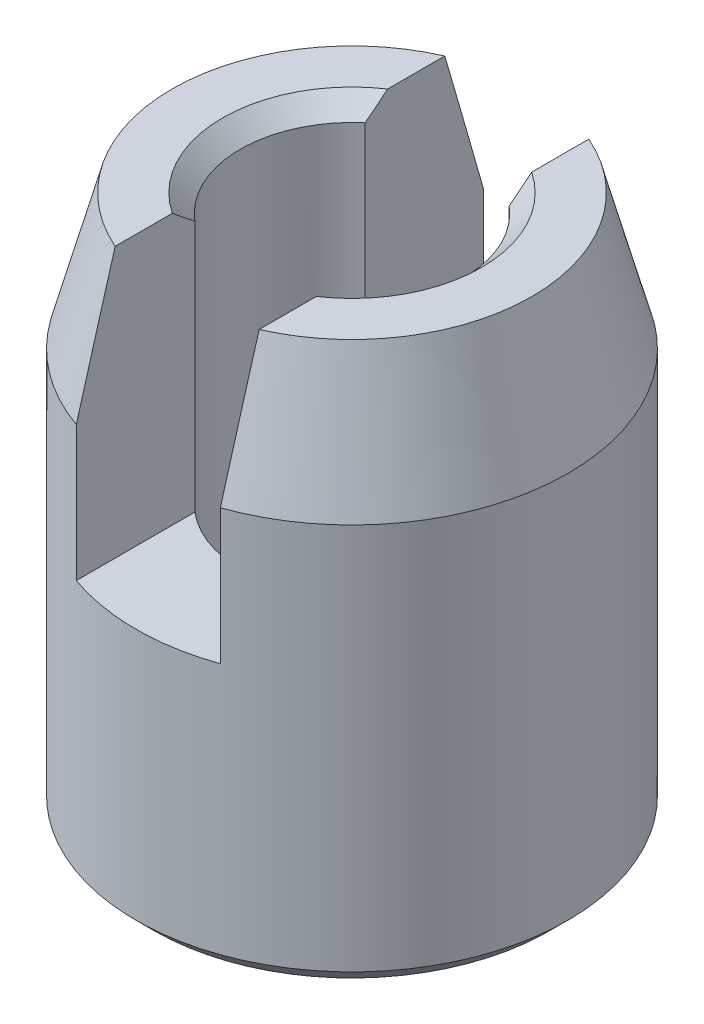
ISO-10303-21;
HEADER;
FILE_DESCRIPTION(('STEP AP214'),'2;1');
FILE_NAME('part.step','',(''),(''),'','','');
FILE_SCHEMA(('AUTOMOTIVE_DESIGN { 1 0 10303 214 1 1 1 1 }'));
ENDSEC;
DATA;
#1=APPLICATION_CONTEXT('core data for automotive mechanical design processes');
#2=APPLICATION_PROTOCOL_DEFINITION('international standard','automotive_design',2000,#1);
#3=PRODUCT_CONTEXT('',#1,'mechanical');
#4=PRODUCT('Part','Part','',(#3));
#5=PRODUCT_RELATED_PRODUCT_CATEGORY('part','',(#4));
#6=PRODUCT_DEFINITION_FORMATION('','',#4);
#7=PRODUCT_DEFINITION_CONTEXT('part definition',#1,'design');
#8=PRODUCT_DEFINITION('design','',#6,#7);
#9=PRODUCT_DEFINITION_SHAPE('','',#8);
#10=(LENGTH_UNIT() NAMED_UNIT(*) SI_UNIT(.MILLI.,.METRE.));
#11=(NAMED_UNIT(*) PLANE_ANGLE_UNIT() SI_UNIT($,.RADIAN.));
#12=(NAMED_UNIT(*) SI_UNIT($,.STERADIAN.) SOLID_ANGLE_UNIT());
#13=UNCERTAINTY_MEASURE_WITH_UNIT(LENGTH_MEASURE(1.E-05),#10,'distance_accuracy_value','');
#14=(GEOMETRIC_REPRESENTATION_CONTEXT(3) GLOBAL_UNCERTAINTY_ASSIGNED_CONTEXT((#13)) GLOBAL_UNIT_ASSIGNED_CONTEXT((#10,
#11,#12)) REPRESENTATION_CONTEXT('',''));
#15=CARTESIAN_POINT('',(0.,0.,0.));
#16=DIRECTION('',(0.,0.,1.));
#17=DIRECTION('',(1.,0.,0.));
#18=AXIS2_PLACEMENT_3D('',#15,#16,#17);
#19=CARTESIAN_POINT('',(0.,7.5,0.));
#20=DIRECTION('',(0.,-1.,0.));
#21=DIRECTION('',(0.,0.,-1.));
#22=AXIS2_PLACEMENT_3D('',#19,#20,#21);
#23=CONICAL_SURFACE('',#22,4.,0.261799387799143);
#24=CARTESIAN_POINT('',(-1.33333333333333,3.30287941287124,-4.94812104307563));
#25=CARTESIAN_POINT('',(-1.33333333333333,3.76667270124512,-4.81940175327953));
#26=CARTESIAN_POINT('',(-1.33333333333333,4.23038543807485,-4.69039061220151));
#27=CARTESIAN_POINT('',(-1.33333333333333,5.1575795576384,-4.43155915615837));
#28=CARTESIAN_POINT('',(-1.33333333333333,5.62106094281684,-4.30173884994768));
#29=CARTESIAN_POINT('',(-1.33333333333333,6.54767419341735,-4.04107711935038));
#30=CARTESIAN_POINT('',(-1.33333333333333,7.01080609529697,-3.91023582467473));
#31=CARTESIAN_POINT('',(-1.33333333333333,7.93668107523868,-3.64715917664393));
#32=CARTESIAN_POINT('',(-1.33333333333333,8.3994241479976,-3.51492380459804));
#33=CARTESIAN_POINT('',(-1.33333333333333,9.32443255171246,-3.24849946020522));
#34=CARTESIAN_POINT('',(-1.33333333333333,9.78669778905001,-3.11431016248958));
#35=CARTESIAN_POINT('',(-1.33333333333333,10.7104004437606,-2.84315251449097));
#36=CARTESIAN_POINT('',(-1.33333333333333,11.1718378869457,-2.70618425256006));
#37=CARTESIAN_POINT('',(-1.33333333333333,11.8630499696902,-2.49747216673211));
#38=CARTESIAN_POINT('',(-1.33333333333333,12.0933145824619,-2.42735259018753));
#39=CARTESIAN_POINT('',(-1.33333333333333,12.5534081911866,-2.28570776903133));
#40=CARTESIAN_POINT('',(-1.33333333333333,12.7832371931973,-2.21418254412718));
#41=CARTESIAN_POINT('',(-1.33333333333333,13.242339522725,-2.06927798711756));
#42=CARTESIAN_POINT('',(-1.33333333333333,13.4716127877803,-1.99589845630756));
#43=CARTESIAN_POINT('',(-1.33333333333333,13.8149095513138,-1.88392981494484));
#44=CARTESIAN_POINT('',(-1.33333333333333,13.9292423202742,-1.84628946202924));
#45=CARTESIAN_POINT('',(-1.33333333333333,14.1576550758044,-1.77024485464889));
#46=CARTESIAN_POINT('',(-1.33333333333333,14.2717350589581,-1.73184058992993));
#47=CARTESIAN_POINT('',(-1.33333333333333,14.3856638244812,-1.69298921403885));
#48=B_SPLINE_CURVE_WITH_KNOTS('',3,(#24,#25,#26,#27,#28,#29,#30,#31,#32,#33,#34,#35,#36,#37,#38,
#39,#40,#41,#42,#43,#44,#45,#46,#47),.UNSPECIFIED.,.F.,.F.,(4,2,2,2,2,2,2,2,2,2,2,4),(0.,
1.44397280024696,2.88793000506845,4.33170665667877,5.7755026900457,7.21954195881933,
8.66353538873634,9.38564481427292,10.1077441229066,10.8299211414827,11.1910267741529,
11.5521372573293),.UNSPECIFIED.);
#49=CARTESIAN_POINT('',(-1.33333333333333,7.5,-3.77123616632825));
#50=VERTEX_POINT('',#49);
#51=CARTESIAN_POINT('',(-1.33333333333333,10.,-3.05155176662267));
#52=VERTEX_POINT('',#51);
#53=EDGE_CURVE('E234',#50,#52,#48,.T.);
#54=ORIENTED_EDGE('',*,*,#53,.F.);
#55=CARTESIAN_POINT('',(0.,7.5,0.));
#56=DIRECTION('',(0.,-1.,0.));
#57=DIRECTION('',(0.,0.,-1.));
#58=AXIS2_PLACEMENT_3D('',#55,#56,#57);
#59=CIRCLE('',#58,4.);
#60=CARTESIAN_POINT('',(-1.33333333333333,7.5,3.77123616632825));
#61=VERTEX_POINT('',#60);
#62=EDGE_CURVE('E144',#61,#50,#59,.T.);
#63=ORIENTED_EDGE('',*,*,#62,.F.);
#64=CARTESIAN_POINT('',(-1.33333333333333,14.3856638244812,1.69298921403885));
#65=CARTESIAN_POINT('',(-1.33333333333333,14.2505746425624,1.73905214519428));
#66=CARTESIAN_POINT('',(-1.33333333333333,14.1152752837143,1.7844921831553));
#67=CARTESIAN_POINT('',(-1.33333333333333,13.8443341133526,1.87433172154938));
#68=CARTESIAN_POINT('',(-1.33333333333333,13.7086923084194,1.91873124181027));
#69=CARTESIAN_POINT('',(-1.33333333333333,13.301378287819,2.05067431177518));
#70=CARTESIAN_POINT('',(-1.33333333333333,13.0293015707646,2.13696773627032));
#71=CARTESIAN_POINT('',(-1.33333333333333,12.4844592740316,2.30721772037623));
#72=CARTESIAN_POINT('',(-1.33333333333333,12.2116937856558,2.39117457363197));
#73=CARTESIAN_POINT('',(-1.33333333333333,11.6656389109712,2.55738011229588));
#74=CARTESIAN_POINT('',(-1.33333333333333,11.3923495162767,2.63962877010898));
#75=CARTESIAN_POINT('',(-1.33333333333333,10.7432984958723,2.83329771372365));
#76=CARTESIAN_POINT('',(-1.33333333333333,10.367366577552,2.94414652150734));
#77=CARTESIAN_POINT('',(-1.33333333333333,9.61498112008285,3.1641183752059));
#78=CARTESIAN_POINT('',(-1.33333333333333,9.23852755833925,3.27324134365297));
#79=CARTESIAN_POINT('',(-1.33333333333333,8.39936812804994,3.51494091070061));
#80=CARTESIAN_POINT('',(-1.33333333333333,7.93656847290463,3.6471916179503));
#81=CARTESIAN_POINT('',(-1.33333333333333,7.0105733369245,3.91030151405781));
#82=CARTESIAN_POINT('',(-1.33333333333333,6.54737785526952,4.04116070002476));
#83=CARTESIAN_POINT('',(-1.33333333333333,5.62075701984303,4.30182412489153));
#84=CARTESIAN_POINT('',(-1.33333333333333,5.15733170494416,4.43162850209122));
#85=CARTESIAN_POINT('',(-1.33333333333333,4.23025756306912,4.69042615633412));
#86=CARTESIAN_POINT('',(-1.33333333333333,3.7666087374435,4.81941943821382));
#87=CARTESIAN_POINT('',(-1.33333333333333,3.30287941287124,4.94812104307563));
#88=B_SPLINE_CURVE_WITH_KNOTS('',3,(#64,#65,#66,#67,#68,#69,#70,#71,#72,#73,#74,#75,#76,#77,#78,
#79,#80,#81,#82,#83,#84,#85,#86,#87),.UNSPECIFIED.,.F.,.F.,(4,2,2,2,2,2,2,2,2,2,2,4),(0.,
0.428175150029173,0.856342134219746,1.7126257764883,2.56880131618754,3.42499067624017,
4.60078645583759,5.77663486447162,7.22060668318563,8.6645815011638,10.1083638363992,
11.5521375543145),.UNSPECIFIED.);
#89=CARTESIAN_POINT('',(-1.33333333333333,10.,3.05155176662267));
#90=VERTEX_POINT('',#89);
#91=EDGE_CURVE('E217',#90,#61,#88,.T.);
#92=ORIENTED_EDGE('',*,*,#91,.F.);
#93=CARTESIAN_POINT('',(0.,10.,0.));
#94=DIRECTION('',(0.,-1.,0.));
#95=DIRECTION('',(0.,0.,-1.));
#96=AXIS2_PLACEMENT_3D('',#93,#94,#95);
#97=CIRCLE('',#96,3.33012701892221);
#98=EDGE_CURVE('E145',#90,#52,#97,.T.);
#99=ORIENTED_EDGE('',*,*,#98,.T.);
#100=EDGE_LOOP('',(#54,#63,#92,#99));
#101=FACE_BOUND('',#100,.T.);
#102=ADVANCED_FACE('F31',(#101),#23,.T.);
#103=CARTESIAN_POINT('',(2.065,10.,0.));
#104=DIRECTION('',(0.,1.,0.));
#105=DIRECTION('',(0.,0.,1.));
#106=AXIS2_PLACEMENT_3D('',#103,#104,#105);
#107=PLANE('',#106);
#108=DIRECTION('',(0.,0.,1.));
#109=VECTOR('',#108,1.);
#110=CARTESIAN_POINT('',(-1.33333333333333,10.,-4.));
#111=LINE('',#110,#109);
#112=CARTESIAN_POINT('',(-1.33333333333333,10.,-1.99354583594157));
#113=VERTEX_POINT('',#112);
#114=EDGE_CURVE('E268',#52,#113,#111,.T.);
#115=ORIENTED_EDGE('',*,*,#114,.F.);
#116=ORIENTED_EDGE('',*,*,#98,.F.);
#117=CARTESIAN_POINT('',(-1.33333333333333,10.,1.99354583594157));
#118=VERTEX_POINT('',#117);
#119=EDGE_CURVE('E130',#118,#90,#111,.T.);
#120=ORIENTED_EDGE('',*,*,#119,.F.);
#121=CARTESIAN_POINT('',(0.,10.,0.));
#122=DIRECTION('',(0.,1.,0.));
#123=DIRECTION('',(0.,0.,1.));
#124=AXIS2_PLACEMENT_3D('',#121,#122,#123);
#125=CIRCLE('',#124,2.39833333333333);
#126=EDGE_CURVE('E171',#118,#113,#125,.F.);
#127=ORIENTED_EDGE('',*,*,#126,.T.);
#128=EDGE_LOOP('',(#115,#116,#120,#127));
#129=FACE_BOUND('',#128,.T.);
#130=ADVANCED_FACE('F283',(#129),#107,.T.);
#131=CARTESIAN_POINT('',(0.,10.,0.));
#132=DIRECTION('',(0.,1.,0.));
#133=DIRECTION('',(0.,0.,1.));
#134=AXIS2_PLACEMENT_3D('',#131,#132,#133);
#135=CONICAL_SURFACE('',#134,2.39833333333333,0.785398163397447);
#136=CARTESIAN_POINT('',(-1.33333333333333,12.8851409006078,-5.11246733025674));
#137=CARTESIAN_POINT('',(-1.33333333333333,12.7720505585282,-4.99558745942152));
#138=CARTESIAN_POINT('',(-1.33333333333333,12.6590811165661,-4.87859021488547));
#139=CARTESIAN_POINT('',(-1.33333333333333,12.4334565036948,-4.64429014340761));
#140=CARTESIAN_POINT('',(-1.33333333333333,12.3208013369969,-4.5269873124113));
#141=CARTESIAN_POINT('',(-1.33333333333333,12.0958208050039,-4.29194570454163));
#142=CARTESIAN_POINT('',(-1.33333333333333,11.9834956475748,-4.17420672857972));
#143=CARTESIAN_POINT('',(-1.33333333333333,11.7593439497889,-3.9382562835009));
#144=CARTESIAN_POINT('',(-1.33333333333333,11.6475174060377,-3.82004481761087));
#145=CARTESIAN_POINT('',(-1.33333333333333,11.4267661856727,-3.58540908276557));
#146=CARTESIAN_POINT('',(-1.33333333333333,11.3178285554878,-3.4689970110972));
#147=CARTESIAN_POINT('',(-1.33333333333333,11.1007770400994,-3.23540771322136));
#148=CARTESIAN_POINT('',(-1.33333333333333,10.9926631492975,-3.1182304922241));
#149=CARTESIAN_POINT('',(-1.33333333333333,10.7775840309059,-2.8828732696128));
#150=CARTESIAN_POINT('',(-1.33333333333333,10.6706185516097,-2.76469349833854));
#151=CARTESIAN_POINT('',(-1.33333333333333,10.4582753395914,-2.52691843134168));
#152=CARTESIAN_POINT('',(-1.33333333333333,10.3528975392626,-2.40732319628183));
#153=CARTESIAN_POINT('',(-1.33333333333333,10.1859047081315,-2.21400946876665));
#154=CARTESIAN_POINT('',(-1.33333333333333,10.1235366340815,-2.14094230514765));
#155=CARTESIAN_POINT('',(-1.33333333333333,9.99992136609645,-1.99385099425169));
#156=CARTESIAN_POINT('',(-1.33333333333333,9.93867428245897,-1.91982675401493));
#157=CARTESIAN_POINT('',(-1.33333333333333,9.81703718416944,-1.76975802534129));
#158=CARTESIAN_POINT('',(-1.33333333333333,9.75666330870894,-1.69370040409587));
#159=CARTESIAN_POINT('',(-1.33333333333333,9.63804913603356,-1.53995816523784));
#160=CARTESIAN_POINT('',(-1.33333333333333,9.57980833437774,-1.4622739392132));
#161=CARTESIAN_POINT('',(-1.33333333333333,9.46547754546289,-1.30349707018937));
#162=CARTESIAN_POINT('',(-1.33333333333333,9.40943443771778,-1.22237037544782));
#163=CARTESIAN_POINT('',(-1.33333333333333,9.30193196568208,-1.05692445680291));
#164=CARTESIAN_POINT('',(-1.33333333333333,9.25047889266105,-0.972601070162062));
#165=CARTESIAN_POINT('',(-1.33333333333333,9.15543762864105,-0.800934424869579));
#166=CARTESIAN_POINT('',(-1.33333333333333,9.11175888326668,-0.713642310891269));
#167=CARTESIAN_POINT('',(-1.33333333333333,9.03578997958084,-0.534273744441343));
#168=CARTESIAN_POINT('',(-1.33333333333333,9.00346149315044,-0.442214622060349));
#169=CARTESIAN_POINT('',(-1.33333333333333,8.96858458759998,-0.304125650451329));
#170=CARTESIAN_POINT('',(-1.33333333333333,8.95935353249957,-0.259781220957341));
#171=CARTESIAN_POINT('',(-1.33333333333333,8.94512243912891,-0.170405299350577));
#172=CARTESIAN_POINT('',(-1.33333333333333,8.94012204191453,-0.125373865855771));
#173=CARTESIAN_POINT('',(-1.33333333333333,8.93470598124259,-0.0351651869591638));
#174=CARTESIAN_POINT('',(-1.33333333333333,8.93427681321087,0.0100112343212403));
#175=CARTESIAN_POINT('',(-1.33333333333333,8.93799866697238,0.100175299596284));
#176=CARTESIAN_POINT('',(-1.33333333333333,8.94215008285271,0.145162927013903));
#177=CARTESIAN_POINT('',(-1.33333333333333,8.95468845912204,0.234124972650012));
#178=CARTESIAN_POINT('',(-1.33333333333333,8.96303754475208,0.278104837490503));
#179=CARTESIAN_POINT('',(-1.33333333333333,8.98345923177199,0.365194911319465));
#180=CARTESIAN_POINT('',(-1.33333333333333,8.99553328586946,0.408304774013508));
#181=CARTESIAN_POINT('',(-1.33333333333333,9.02290092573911,0.493738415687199));
#182=CARTESIAN_POINT('',(-1.33333333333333,9.03821185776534,0.536056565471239));
#183=CARTESIAN_POINT('',(-1.33333333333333,9.07144640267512,0.619630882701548));
#184=CARTESIAN_POINT('',(-1.33333333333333,9.08936947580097,0.660887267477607));
#185=CARTESIAN_POINT('',(-1.33333333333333,9.14683592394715,0.784311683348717));
#186=CARTESIAN_POINT('',(-1.33333333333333,9.18966657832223,0.864944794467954));
#187=CARTESIAN_POINT('',(-1.33333333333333,9.28098083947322,1.02297209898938));
#188=CARTESIAN_POINT('',(-1.33333333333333,9.32947141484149,1.10036213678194));
#189=CARTESIAN_POINT('',(-1.33333333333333,9.43041965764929,1.25293169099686));
#190=CARTESIAN_POINT('',(-1.33333333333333,9.48289233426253,1.32810119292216));
#191=CARTESIAN_POINT('',(-1.33333333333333,9.59043097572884,1.47648635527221));
#192=CARTESIAN_POINT('',(-1.33333333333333,9.64549564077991,1.54970296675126));
#193=CARTESIAN_POINT('',(-1.33333333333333,9.75823810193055,1.6956402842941));
#194=CARTESIAN_POINT('',(-1.33333333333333,9.8159408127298,1.76834165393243));
#195=CARTESIAN_POINT('',(-1.33333333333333,9.9327687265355,1.91260030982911));
#196=CARTESIAN_POINT('',(-1.33333333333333,9.99189408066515,1.98415747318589));
#197=CARTESIAN_POINT('',(-1.33333333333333,10.1705628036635,2.19715010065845));
#198=CARTESIAN_POINT('',(-1.33333333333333,10.2916801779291,2.33726306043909));
#199=CARTESIAN_POINT('',(-1.33333333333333,10.5156132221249,2.5915709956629));
#200=CARTESIAN_POINT('',(-1.33333333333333,10.6180339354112,2.70611710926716));
#201=CARTESIAN_POINT('',(-1.33333333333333,10.8241271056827,2.93408324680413));
#202=CARTESIAN_POINT('',(-1.33333333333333,10.9277995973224,3.04750323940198));
#203=CARTESIAN_POINT('',(-1.33333333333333,11.2403481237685,3.38674425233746));
#204=CARTESIAN_POINT('',(-1.33333333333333,11.4505622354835,3.61133010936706));
#205=CARTESIAN_POINT('',(-1.33333333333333,11.8643412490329,4.04937980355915));
#206=CARTESIAN_POINT('',(-1.33333333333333,12.0678242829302,4.26292134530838));
#207=CARTESIAN_POINT('',(-1.33333333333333,12.3738517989,4.58223599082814));
#208=CARTESIAN_POINT('',(-1.33333333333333,12.4759376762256,4.68844900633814));
#209=CARTESIAN_POINT('',(-1.33333333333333,12.6803622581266,4.90062983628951));
#210=CARTESIAN_POINT('',(-1.33333333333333,12.7827009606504,5.00659765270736));
#211=CARTESIAN_POINT('',(-1.33333333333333,12.8851409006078,5.11246733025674));
#212=B_SPLINE_CURVE_WITH_KNOTS('',3,(#136,#137,#138,#139,#140,#141,#142,#143,#144,#145,#146,
#147,#148,#149,#150,#151,#152,#153,#154,#155,#156,#157,#158,#159,#160,#161,#162,#163,#164,#165,
#166,#167,#168,#169,#170,#171,#172,#173,#174,#175,#176,#177,#178,#179,#180,#181,#182,#183,#184,
#185,#186,#187,#188,#189,#190,#191,#192,#193,#194,#195,#196,#197,#198,#199,#200,#201,#202,#203,
#204,#205,#206,#207,#208,#209,#210,#211),.UNSPECIFIED.,.F.,.F.,(4,2,2,2,2,2,2,2,2,2,2,2,2,2,2,2,
2,2,2,2,2,2,2,2,2,2,2,2,2,2,2,2,2,2,2,2,2,4),(0.,0.487907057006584,0.975820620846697,
1.46399432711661,1.95216470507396,2.43046365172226,2.90875934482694,3.38694797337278,
3.86511618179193,4.15330451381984,4.44152105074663,4.73281570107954,5.02404101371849,
5.31974710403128,5.61585246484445,5.90824377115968,6.19963799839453,6.33535061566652,
6.47105171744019,6.6063518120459,6.74166354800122,6.87577573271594,7.00994028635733,
7.14484292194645,7.27971772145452,7.55322232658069,7.82706729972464,8.10200127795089,
8.37679882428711,8.65522745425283,8.93368579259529,9.48924101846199,9.95020746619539,
10.4111867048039,11.3340144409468,12.2189092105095,12.6608642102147,13.102815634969),.UNSPECIFIED.);
#213=CARTESIAN_POINT('',(-1.33333333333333,9.66666666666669,-1.57684724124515));
#214=VERTEX_POINT('',#213);
#215=EDGE_CURVE('E277',#113,#214,#212,.T.);
#216=ORIENTED_EDGE('',*,*,#215,.F.);
#217=ORIENTED_EDGE('',*,*,#126,.F.);
#218=CARTESIAN_POINT('',(-1.33333333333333,9.66666666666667,1.57684724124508));
#219=VERTEX_POINT('',#218);
#220=EDGE_CURVE('E179',#219,#118,#212,.T.);
#221=ORIENTED_EDGE('',*,*,#220,.F.);
#222=CARTESIAN_POINT('',(0.,9.66666666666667,0.));
#223=DIRECTION('',(0.,1.,0.));
#224=DIRECTION('',(0.,0.,1.));
#225=AXIS2_PLACEMENT_3D('',#222,#223,#224);
#226=CIRCLE('',#225,2.065);
#227=EDGE_CURVE('E163',#214,#219,#226,.T.);
#228=ORIENTED_EDGE('',*,*,#227,.F.);
#229=EDGE_LOOP('',(#216,#217,#221,#228));
#230=FACE_BOUND('',#229,.T.);
#231=ADVANCED_FACE('F205',(#230),#135,.F.);
#232=CARTESIAN_POINT('',(1.33333333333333,14.3856638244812,-1.69298921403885));
#233=CARTESIAN_POINT('',(1.33333333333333,14.2505746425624,-1.73905214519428));
#234=CARTESIAN_POINT('',(1.33333333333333,14.1152752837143,-1.7844921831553));
#235=CARTESIAN_POINT('',(1.33333333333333,13.8443341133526,-1.87433172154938));
#236=CARTESIAN_POINT('',(1.33333333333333,13.7086923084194,-1.91873124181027));
#237=CARTESIAN_POINT('',(1.33333333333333,13.301378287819,-2.05067431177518));
#238=CARTESIAN_POINT('',(1.33333333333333,13.0293015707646,-2.13696773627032));
#239=CARTESIAN_POINT('',(1.33333333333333,12.4844592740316,-2.30721772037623));
#240=CARTESIAN_POINT('',(1.33333333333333,12.2116937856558,-2.39117457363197));
#241=CARTESIAN_POINT('',(1.33333333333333,11.6656389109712,-2.55738011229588));
#242=CARTESIAN_POINT('',(1.33333333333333,11.3923495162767,-2.63962877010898));
#243=CARTESIAN_POINT('',(1.33333333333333,10.7432984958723,-2.83329771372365));
#244=CARTESIAN_POINT('',(1.33333333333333,10.367366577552,-2.94414652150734));
#245=CARTESIAN_POINT('',(1.33333333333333,9.61498112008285,-3.1641183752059));
#246=CARTESIAN_POINT('',(1.33333333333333,9.23852755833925,-3.27324134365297));
#247=CARTESIAN_POINT('',(1.33333333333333,8.39936812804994,-3.51494091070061));
#248=CARTESIAN_POINT('',(1.33333333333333,7.93656847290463,-3.6471916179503));
#249=CARTESIAN_POINT('',(1.33333333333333,7.0105733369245,-3.91030151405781));
#250=CARTESIAN_POINT('',(1.33333333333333,6.54737785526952,-4.04116070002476));
#251=CARTESIAN_POINT('',(1.33333333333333,5.62075701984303,-4.30182412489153));
#252=CARTESIAN_POINT('',(1.33333333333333,5.15733170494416,-4.43162850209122));
#253=CARTESIAN_POINT('',(1.33333333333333,4.23025756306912,-4.69042615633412));
#254=CARTESIAN_POINT('',(1.33333333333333,3.7666087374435,-4.81941943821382));
#255=CARTESIAN_POINT('',(1.33333333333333,3.30287941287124,-4.94812104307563));
#256=B_SPLINE_CURVE_WITH_KNOTS('',3,(#232,#233,#234,#235,#236,#237,#238,#239,#240,#241,#242,
#243,#244,#245,#246,#247,#248,#249,#250,#251,#252,#253,#254,#255),.UNSPECIFIED.,.F.,.F.,(4,2,2,
2,2,2,2,2,2,2,2,4),(0.,0.428175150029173,0.856342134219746,1.7126257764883,2.56880131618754,
3.42499067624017,4.60078645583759,5.77663486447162,7.22060668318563,8.6645815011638,
10.1083638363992,11.5521375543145),.UNSPECIFIED.);
#257=CARTESIAN_POINT('',(1.33333333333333,10.,-3.05155176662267));
#258=VERTEX_POINT('',#257);
#259=CARTESIAN_POINT('',(1.33333333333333,7.5,-3.77123616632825));
#260=VERTEX_POINT('',#259);
#261=EDGE_CURVE('E123',#258,#260,#256,.T.);
#262=ORIENTED_EDGE('',*,*,#261,.F.);
#263=CARTESIAN_POINT('',(1.33333333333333,10.,3.05155176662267));
#264=VERTEX_POINT('',#263);
#265=EDGE_CURVE('E137',#258,#264,#97,.T.);
#266=ORIENTED_EDGE('',*,*,#265,.T.);
#267=CARTESIAN_POINT('',(1.33333333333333,3.30287941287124,4.94812104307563));
#268=CARTESIAN_POINT('',(1.33333333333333,3.76667270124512,4.81940175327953));
#269=CARTESIAN_POINT('',(1.33333333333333,4.23038543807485,4.69039061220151));
#270=CARTESIAN_POINT('',(1.33333333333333,5.1575795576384,4.43155915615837));
#271=CARTESIAN_POINT('',(1.33333333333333,5.62106094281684,4.30173884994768));
#272=CARTESIAN_POINT('',(1.33333333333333,6.54767419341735,4.04107711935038));
#273=CARTESIAN_POINT('',(1.33333333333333,7.01080609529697,3.91023582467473));
#274=CARTESIAN_POINT('',(1.33333333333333,7.93668107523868,3.64715917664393));
#275=CARTESIAN_POINT('',(1.33333333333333,8.3994241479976,3.51492380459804));
#276=CARTESIAN_POINT('',(1.33333333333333,9.32443255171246,3.24849946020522));
#277=CARTESIAN_POINT('',(1.33333333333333,9.78669778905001,3.11431016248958));
#278=CARTESIAN_POINT('',(1.33333333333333,10.7104004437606,2.84315251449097));
#279=CARTESIAN_POINT('',(1.33333333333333,11.1718378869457,2.70618425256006));
#280=CARTESIAN_POINT('',(1.33333333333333,11.8630499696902,2.49747216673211));
#281=CARTESIAN_POINT('',(1.33333333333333,12.0933145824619,2.42735259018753));
#282=CARTESIAN_POINT('',(1.33333333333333,12.5534081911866,2.28570776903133));
#283=CARTESIAN_POINT('',(1.33333333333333,12.7832371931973,2.21418254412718));
#284=CARTESIAN_POINT('',(1.33333333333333,13.242339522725,2.06927798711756));
#285=CARTESIAN_POINT('',(1.33333333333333,13.4716127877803,1.99589845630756));
#286=CARTESIAN_POINT('',(1.33333333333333,13.8149095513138,1.88392981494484));
#287=CARTESIAN_POINT('',(1.33333333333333,13.9292423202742,1.84628946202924));
#288=CARTESIAN_POINT('',(1.33333333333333,14.1576550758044,1.77024485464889));
#289=CARTESIAN_POINT('',(1.33333333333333,14.2717350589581,1.73184058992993));
#290=CARTESIAN_POINT('',(1.33333333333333,14.3856638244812,1.69298921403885));
#291=B_SPLINE_CURVE_WITH_KNOTS('',3,(#267,#268,#269,#270,#271,#272,#273,#274,#275,#276,#277,
#278,#279,#280,#281,#282,#283,#284,#285,#286,#287,#288,#289,#290),.UNSPECIFIED.,.F.,.F.,(4,2,2,
2,2,2,2,2,2,2,2,4),(0.,1.44397280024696,2.88793000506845,4.33170665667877,5.7755026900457,
7.21954195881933,8.66353538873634,9.38564481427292,10.1077441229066,10.8299211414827,
11.1910267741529,11.5521372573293),.UNSPECIFIED.);
#292=CARTESIAN_POINT('',(1.33333333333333,7.5,3.77123616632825));
#293=VERTEX_POINT('',#292);
#294=EDGE_CURVE('E211',#293,#264,#291,.T.);
#295=ORIENTED_EDGE('',*,*,#294,.F.);
#296=EDGE_CURVE('E139',#260,#293,#59,.T.);
#297=ORIENTED_EDGE('',*,*,#296,.F.);
#298=EDGE_LOOP('',(#262,#266,#295,#297));
#299=FACE_BOUND('',#298,.T.);
#300=ADVANCED_FACE('F135',(#299),#23,.T.);
#301=CARTESIAN_POINT('',(0.,0.,0.));
#302=DIRECTION('',(0.,-1.,0.));
#303=DIRECTION('',(0.,0.,-1.));
#304=AXIS2_PLACEMENT_3D('',#301,#302,#303);
#305=CYLINDRICAL_SURFACE('',#304,4.);
#306=DIRECTION('',(0.,-1.,0.));
#307=VECTOR('',#306,1.);
#308=CARTESIAN_POINT('',(-1.33333333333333,0.,-3.77123616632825));
#309=LINE('',#308,#307);
#310=CARTESIAN_POINT('',(-1.33333333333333,5.,-3.77123616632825));
#311=VERTEX_POINT('',#310);
#312=EDGE_CURVE('E223',#311,#50,#309,.F.);
#313=ORIENTED_EDGE('',*,*,#312,.F.);
#314=CARTESIAN_POINT('',(0.,5.,0.));
#315=DIRECTION('',(0.,-1.,0.));
#316=DIRECTION('',(0.,0.,-1.));
#317=AXIS2_PLACEMENT_3D('',#314,#315,#316);
#318=CIRCLE('',#317,4.);
#319=CARTESIAN_POINT('',(1.33333333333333,5.,-3.77123616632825));
#320=VERTEX_POINT('',#319);
#321=EDGE_CURVE('E238',#320,#311,#318,.F.);
#322=ORIENTED_EDGE('',*,*,#321,.F.);
#323=DIRECTION('',(0.,-1.,0.));
#324=VECTOR('',#323,1.);
#325=CARTESIAN_POINT('',(1.33333333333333,0.,-3.77123616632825));
#326=LINE('',#325,#324);
#327=EDGE_CURVE('E141',#260,#320,#326,.T.);
#328=ORIENTED_EDGE('',*,*,#327,.F.);
#329=ORIENTED_EDGE('',*,*,#296,.T.);
#330=DIRECTION('',(0.,-1.,0.));
#331=VECTOR('',#330,1.);
#332=CARTESIAN_POINT('',(1.33333333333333,0.,3.77123616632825));
#333=LINE('',#332,#331);
#334=CARTESIAN_POINT('',(1.33333333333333,5.,3.77123616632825));
#335=VERTEX_POINT('',#334);
#336=EDGE_CURVE('E140',#335,#293,#333,.F.);
#337=ORIENTED_EDGE('',*,*,#336,.F.);
#338=CARTESIAN_POINT('',(-1.33333333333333,5.,3.77123616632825));
#339=VERTEX_POINT('',#338);
#340=EDGE_CURVE('E150',#339,#335,#318,.F.);
#341=ORIENTED_EDGE('',*,*,#340,.F.);
#342=DIRECTION('',(0.,-1.,0.));
#343=VECTOR('',#342,1.);
#344=CARTESIAN_POINT('',(-1.33333333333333,0.,3.77123616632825));
#345=LINE('',#344,#343);
#346=EDGE_CURVE('E224',#61,#339,#345,.T.);
#347=ORIENTED_EDGE('',*,*,#346,.F.);
#348=ORIENTED_EDGE('',*,*,#62,.T.);
#349=EDGE_LOOP('',(#313,#322,#328,#329,#337,#341,#347,#348));
#350=FACE_BOUND('',#349,.T.);
#351=CARTESIAN_POINT('',(0.,0.33333333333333,0.));
#352=DIRECTION('',(0.,-1.,0.));
#353=DIRECTION('',(0.,0.,-1.));
#354=AXIS2_PLACEMENT_3D('',#351,#352,#353);
#355=CIRCLE('',#354,4.);
#356=CARTESIAN_POINT('',(0.,0.33333333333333,-4.));
#357=VERTEX_POINT('',#356);
#358=EDGE_CURVE('E160',#357,#357,#355,.F.);
#359=ORIENTED_EDGE('',*,*,#358,.T.);
#360=EDGE_LOOP('',(#359));
#361=FACE_BOUND('',#360,.T.);
#362=ADVANCED_FACE('F204',(#350,#361),#305,.T.);
#363=CARTESIAN_POINT('',(4.,0.,0.));
#364=DIRECTION('',(0.,-1.,0.));
#365=DIRECTION('',(0.,0.,-1.));
#366=AXIS2_PLACEMENT_3D('',#363,#364,#365);
#367=PLANE('',#366);
#368=CARTESIAN_POINT('',(0.,0.,0.));
#369=DIRECTION('',(0.,-1.,0.));
#370=DIRECTION('',(0.,0.,-1.));
#371=AXIS2_PLACEMENT_3D('',#368,#369,#370);
#372=CIRCLE('',#371,3.66666666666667);
#373=CARTESIAN_POINT('',(0.,0.,-3.66666666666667));
#374=VERTEX_POINT('',#373);
#375=EDGE_CURVE('E157',#374,#374,#372,.T.);
#376=ORIENTED_EDGE('',*,*,#375,.T.);
#377=EDGE_LOOP('',(#376));
#378=FACE_BOUND('',#377,.T.);
#379=CARTESIAN_POINT('',(0.,0.,0.));
#380=DIRECTION('',(0.,-1.,0.));
#381=DIRECTION('',(0.,0.,-1.));
#382=AXIS2_PLACEMENT_3D('',#379,#380,#381);
#383=CIRCLE('',#382,2.39833333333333);
#384=CARTESIAN_POINT('',(0.,0.,-2.39833333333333));
#385=VERTEX_POINT('',#384);
#386=EDGE_CURVE('E154',#385,#385,#383,.F.);
#387=ORIENTED_EDGE('',*,*,#386,.T.);
#388=EDGE_LOOP('',(#387));
#389=FACE_BOUND('',#388,.T.);
#390=ADVANCED_FACE('F297',(#378,#389),#367,.T.);
#391=CARTESIAN_POINT('',(0.,0.,0.));
#392=DIRECTION('',(0.,-1.,0.));
#393=DIRECTION('',(0.,0.,-1.));
#394=AXIS2_PLACEMENT_3D('',#391,#392,#393);
#395=CYLINDRICAL_SURFACE('',#394,2.065);
#396=DIRECTION('',(0.,-1.,0.));
#397=VECTOR('',#396,1.);
#398=CARTESIAN_POINT('',(-1.33333333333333,0.,1.57684724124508));
#399=LINE('',#398,#397);
#400=CARTESIAN_POINT('',(-1.33333333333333,5.,1.57684724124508));
#401=VERTEX_POINT('',#400);
#402=EDGE_CURVE('E258',#401,#219,#399,.F.);
#403=ORIENTED_EDGE('',*,*,#402,.F.);
#404=CARTESIAN_POINT('',(0.,5.,0.));
#405=DIRECTION('',(0.,-1.,0.));
#406=DIRECTION('',(0.,0.,-1.));
#407=AXIS2_PLACEMENT_3D('',#404,#405,#406);
#408=CIRCLE('',#407,2.065);
#409=CARTESIAN_POINT('',(1.33333333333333,5.,1.57684724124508));
#410=VERTEX_POINT('',#409);
#411=EDGE_CURVE('E11',#410,#401,#408,.T.);
#412=ORIENTED_EDGE('',*,*,#411,.F.);
#413=DIRECTION('',(0.,-1.,0.));
#414=VECTOR('',#413,1.);
#415=CARTESIAN_POINT('',(1.33333333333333,0.,1.57684724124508));
#416=LINE('',#415,#414);
#417=CARTESIAN_POINT('',(1.33333333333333,9.66666666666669,1.57684724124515));
#418=VERTEX_POINT('',#417);
#419=EDGE_CURVE('E266',#418,#410,#416,.T.);
#420=ORIENTED_EDGE('',*,*,#419,.F.);
#421=CARTESIAN_POINT('',(1.33333333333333,9.66666666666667,-1.57684724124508));
#422=VERTEX_POINT('',#421);
#423=EDGE_CURVE('E164',#418,#422,#226,.T.);
#424=ORIENTED_EDGE('',*,*,#423,.T.);
#425=DIRECTION('',(0.,-1.,0.));
#426=VECTOR('',#425,1.);
#427=CARTESIAN_POINT('',(1.33333333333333,0.,-1.57684724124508));
#428=LINE('',#427,#426);
#429=CARTESIAN_POINT('',(1.33333333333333,5.,-1.57684724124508));
#430=VERTEX_POINT('',#429);
#431=EDGE_CURVE('E55',#430,#422,#428,.F.);
#432=ORIENTED_EDGE('',*,*,#431,.F.);
#433=CARTESIAN_POINT('',(-1.33333333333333,5.,-1.57684724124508));
#434=VERTEX_POINT('',#433);
#435=EDGE_CURVE('E36',#434,#430,#408,.T.);
#436=ORIENTED_EDGE('',*,*,#435,.F.);
#437=DIRECTION('',(0.,-1.,0.));
#438=VECTOR('',#437,1.);
#439=CARTESIAN_POINT('',(-1.33333333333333,0.,-1.57684724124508));
#440=LINE('',#439,#438);
#441=EDGE_CURVE('E257',#214,#434,#440,.T.);
#442=ORIENTED_EDGE('',*,*,#441,.F.);
#443=ORIENTED_EDGE('',*,*,#227,.T.);
#444=EDGE_LOOP('',(#403,#412,#420,#424,#432,#436,#442,#443));
#445=FACE_BOUND('',#444,.T.);
#446=CARTESIAN_POINT('',(0.,0.333333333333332,0.));
#447=DIRECTION('',(0.,-1.,0.));
#448=DIRECTION('',(0.,0.,-1.));
#449=AXIS2_PLACEMENT_3D('',#446,#447,#448);
#450=CIRCLE('',#449,2.065);
#451=CARTESIAN_POINT('',(0.,0.333333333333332,-2.065));
#452=VERTEX_POINT('',#451);
#453=EDGE_CURVE('E167',#452,#452,#450,.T.);
#454=ORIENTED_EDGE('',*,*,#453,.T.);
#455=EDGE_LOOP('',(#454));
#456=FACE_BOUND('',#455,.T.);
#457=ADVANCED_FACE('F290',(#445,#456),#395,.F.);
#458=DIRECTION('',(0.,0.,1.));
#459=VECTOR('',#458,1.);
#460=CARTESIAN_POINT('',(1.33333333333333,10.,-4.));
#461=LINE('',#460,#459);
#462=CARTESIAN_POINT('',(1.33333333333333,10.,1.99354583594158));
#463=VERTEX_POINT('',#462);
#464=EDGE_CURVE('E47',#463,#264,#461,.T.);
#465=ORIENTED_EDGE('',*,*,#464,.T.);
#466=ORIENTED_EDGE('',*,*,#265,.F.);
#467=CARTESIAN_POINT('',(1.33333333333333,10.,-1.99354583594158));
#468=VERTEX_POINT('',#467);
#469=EDGE_CURVE('E119',#258,#468,#461,.T.);
#470=ORIENTED_EDGE('',*,*,#469,.T.);
#471=EDGE_CURVE('E170',#468,#463,#125,.F.);
#472=ORIENTED_EDGE('',*,*,#471,.T.);
#473=EDGE_LOOP('',(#465,#466,#470,#472));
#474=FACE_BOUND('',#473,.T.);
#475=ADVANCED_FACE('F143',(#474),#107,.T.);
#476=CARTESIAN_POINT('',(0.,0.,0.));
#477=DIRECTION('',(0.,1.,0.));
#478=DIRECTION('',(0.,0.,1.));
#479=AXIS2_PLACEMENT_3D('',#476,#477,#478);
#480=CONICAL_SURFACE('',#479,3.66666666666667,0.785398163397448);
#481=ORIENTED_EDGE('',*,*,#358,.F.);
#482=EDGE_LOOP('',(#481));
#483=FACE_BOUND('',#482,.T.);
#484=ORIENTED_EDGE('',*,*,#375,.F.);
#485=EDGE_LOOP('',(#484));
#486=FACE_BOUND('',#485,.T.);
#487=ADVANCED_FACE('F207',(#483,#486),#480,.T.);
#488=CARTESIAN_POINT('',(0.,0.333333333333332,0.));
#489=DIRECTION('',(0.,-1.,0.));
#490=DIRECTION('',(0.,0.,-1.));
#491=AXIS2_PLACEMENT_3D('',#488,#489,#490);
#492=CONICAL_SURFACE('',#491,2.065,0.785398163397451);
#493=ORIENTED_EDGE('',*,*,#386,.F.);
#494=EDGE_LOOP('',(#493));
#495=FACE_BOUND('',#494,.T.);
#496=ORIENTED_EDGE('',*,*,#453,.F.);
#497=EDGE_LOOP('',(#496));
#498=FACE_BOUND('',#497,.T.);
#499=ADVANCED_FACE('F295',(#495,#498),#492,.F.);
#500=CARTESIAN_POINT('',(1.33333333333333,12.8851409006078,5.11246733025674));
#501=CARTESIAN_POINT('',(1.33333333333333,12.7720505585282,4.99558745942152));
#502=CARTESIAN_POINT('',(1.33333333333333,12.6590811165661,4.87859021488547));
#503=CARTESIAN_POINT('',(1.33333333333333,12.4334565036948,4.64429014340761));
#504=CARTESIAN_POINT('',(1.33333333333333,12.3208013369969,4.5269873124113));
#505=CARTESIAN_POINT('',(1.33333333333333,12.0958208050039,4.29194570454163));
#506=CARTESIAN_POINT('',(1.33333333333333,11.9834956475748,4.17420672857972));
#507=CARTESIAN_POINT('',(1.33333333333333,11.7593439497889,3.9382562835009));
#508=CARTESIAN_POINT('',(1.33333333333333,11.6475174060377,3.82004481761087));
#509=CARTESIAN_POINT('',(1.33333333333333,11.4267661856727,3.58540908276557));
#510=CARTESIAN_POINT('',(1.33333333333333,11.3178285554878,3.4689970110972));
#511=CARTESIAN_POINT('',(1.33333333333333,11.1007770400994,3.23540771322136));
#512=CARTESIAN_POINT('',(1.33333333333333,10.9926631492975,3.1182304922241));
#513=CARTESIAN_POINT('',(1.33333333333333,10.7775840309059,2.8828732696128));
#514=CARTESIAN_POINT('',(1.33333333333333,10.6706185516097,2.76469349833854));
#515=CARTESIAN_POINT('',(1.33333333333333,10.4582753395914,2.52691843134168));
#516=CARTESIAN_POINT('',(1.33333333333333,10.3528975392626,2.40732319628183));
#517=CARTESIAN_POINT('',(1.33333333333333,10.1859047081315,2.21400946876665));
#518=CARTESIAN_POINT('',(1.33333333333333,10.1235366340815,2.14094230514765));
#519=CARTESIAN_POINT('',(1.33333333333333,9.99992136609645,1.99385099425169));
#520=CARTESIAN_POINT('',(1.33333333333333,9.93867428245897,1.91982675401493));
#521=CARTESIAN_POINT('',(1.33333333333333,9.81703718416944,1.76975802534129));
#522=CARTESIAN_POINT('',(1.33333333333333,9.75666330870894,1.69370040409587));
#523=CARTESIAN_POINT('',(1.33333333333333,9.63804913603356,1.53995816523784));
#524=CARTESIAN_POINT('',(1.33333333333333,9.57980833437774,1.4622739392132));
#525=CARTESIAN_POINT('',(1.33333333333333,9.46547754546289,1.30349707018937));
#526=CARTESIAN_POINT('',(1.33333333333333,9.40943443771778,1.22237037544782));
#527=CARTESIAN_POINT('',(1.33333333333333,9.30193196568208,1.05692445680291));
#528=CARTESIAN_POINT('',(1.33333333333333,9.25047889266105,0.972601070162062));
#529=CARTESIAN_POINT('',(1.33333333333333,9.15543762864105,0.800934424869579));
#530=CARTESIAN_POINT('',(1.33333333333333,9.11175888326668,0.713642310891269));
#531=CARTESIAN_POINT('',(1.33333333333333,9.03578997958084,0.534273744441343));
#532=CARTESIAN_POINT('',(1.33333333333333,9.00346149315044,0.442214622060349));
#533=CARTESIAN_POINT('',(1.33333333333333,8.96858458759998,0.304125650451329));
#534=CARTESIAN_POINT('',(1.33333333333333,8.95935353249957,0.259781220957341));
#535=CARTESIAN_POINT('',(1.33333333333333,8.94512243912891,0.170405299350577));
#536=CARTESIAN_POINT('',(1.33333333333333,8.94012204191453,0.125373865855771));
#537=CARTESIAN_POINT('',(1.33333333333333,8.93470598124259,0.0351651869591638));
#538=CARTESIAN_POINT('',(1.33333333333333,8.93427681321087,-0.0100112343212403));
#539=CARTESIAN_POINT('',(1.33333333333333,8.93799866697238,-0.100175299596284));
#540=CARTESIAN_POINT('',(1.33333333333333,8.94215008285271,-0.145162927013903));
#541=CARTESIAN_POINT('',(1.33333333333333,8.95468845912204,-0.234124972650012));
#542=CARTESIAN_POINT('',(1.33333333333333,8.96303754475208,-0.278104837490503));
#543=CARTESIAN_POINT('',(1.33333333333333,8.98345923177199,-0.365194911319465));
#544=CARTESIAN_POINT('',(1.33333333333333,8.99553328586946,-0.408304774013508));
#545=CARTESIAN_POINT('',(1.33333333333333,9.02290092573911,-0.493738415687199));
#546=CARTESIAN_POINT('',(1.33333333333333,9.03821185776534,-0.536056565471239));
#547=CARTESIAN_POINT('',(1.33333333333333,9.07144640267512,-0.619630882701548));
#548=CARTESIAN_POINT('',(1.33333333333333,9.08936947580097,-0.660887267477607));
#549=CARTESIAN_POINT('',(1.33333333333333,9.14683592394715,-0.784311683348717));
#550=CARTESIAN_POINT('',(1.33333333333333,9.18966657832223,-0.864944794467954));
#551=CARTESIAN_POINT('',(1.33333333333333,9.28098083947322,-1.02297209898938));
#552=CARTESIAN_POINT('',(1.33333333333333,9.32947141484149,-1.10036213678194));
#553=CARTESIAN_POINT('',(1.33333333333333,9.43041965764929,-1.25293169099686));
#554=CARTESIAN_POINT('',(1.33333333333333,9.48289233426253,-1.32810119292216));
#555=CARTESIAN_POINT('',(1.33333333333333,9.59043097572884,-1.47648635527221));
#556=CARTESIAN_POINT('',(1.33333333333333,9.64549564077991,-1.54970296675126));
#557=CARTESIAN_POINT('',(1.33333333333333,9.75823810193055,-1.6956402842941));
#558=CARTESIAN_POINT('',(1.33333333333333,9.8159408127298,-1.76834165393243));
#559=CARTESIAN_POINT('',(1.33333333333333,9.9327687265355,-1.91260030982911));
#560=CARTESIAN_POINT('',(1.33333333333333,9.99189408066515,-1.98415747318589));
#561=CARTESIAN_POINT('',(1.33333333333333,10.1705628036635,-2.19715010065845));
#562=CARTESIAN_POINT('',(1.33333333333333,10.2916801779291,-2.33726306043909));
#563=CARTESIAN_POINT('',(1.33333333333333,10.5156132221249,-2.5915709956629));
#564=CARTESIAN_POINT('',(1.33333333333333,10.6180339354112,-2.70611710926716));
#565=CARTESIAN_POINT('',(1.33333333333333,10.8241271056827,-2.93408324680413));
#566=CARTESIAN_POINT('',(1.33333333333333,10.9277995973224,-3.04750323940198));
#567=CARTESIAN_POINT('',(1.33333333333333,11.2403481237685,-3.38674425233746));
#568=CARTESIAN_POINT('',(1.33333333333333,11.4505622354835,-3.61133010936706));
#569=CARTESIAN_POINT('',(1.33333333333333,11.8643412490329,-4.04937980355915));
#570=CARTESIAN_POINT('',(1.33333333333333,12.0678242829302,-4.26292134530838));
#571=CARTESIAN_POINT('',(1.33333333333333,12.3738517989,-4.58223599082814));
#572=CARTESIAN_POINT('',(1.33333333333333,12.4759376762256,-4.68844900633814));
#573=CARTESIAN_POINT('',(1.33333333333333,12.6803622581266,-4.90062983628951));
#574=CARTESIAN_POINT('',(1.33333333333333,12.7827009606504,-5.00659765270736));
#575=CARTESIAN_POINT('',(1.33333333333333,12.8851409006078,-5.11246733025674));
#576=B_SPLINE_CURVE_WITH_KNOTS('',3,(#500,#501,#502,#503,#504,#505,#506,#507,#508,#509,#510,
#511,#512,#513,#514,#515,#516,#517,#518,#519,#520,#521,#522,#523,#524,#525,#526,#527,#528,#529,
#530,#531,#532,#533,#534,#535,#536,#537,#538,#539,#540,#541,#542,#543,#544,#545,#546,#547,#548,
#549,#550,#551,#552,#553,#554,#555,#556,#557,#558,#559,#560,#561,#562,#563,#564,#565,#566,#567,
#568,#569,#570,#571,#572,#573,#574,#575),.UNSPECIFIED.,.F.,.F.,(4,2,2,2,2,2,2,2,2,2,2,2,2,2,2,2,
2,2,2,2,2,2,2,2,2,2,2,2,2,2,2,2,2,2,2,2,2,4),(0.,0.487907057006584,0.975820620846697,
1.46399432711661,1.95216470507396,2.43046365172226,2.90875934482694,3.38694797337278,
3.86511618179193,4.15330451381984,4.44152105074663,4.73281570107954,5.02404101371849,
5.31974710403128,5.61585246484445,5.90824377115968,6.19963799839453,6.33535061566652,
6.47105171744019,6.6063518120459,6.74166354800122,6.87577573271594,7.00994028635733,
7.14484292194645,7.27971772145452,7.55322232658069,7.82706729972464,8.10200127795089,
8.37679882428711,8.65522745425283,8.93368579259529,9.48924101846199,9.95020746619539,
10.4111867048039,11.3340144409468,12.2189092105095,12.6608642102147,13.102815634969),.UNSPECIFIED.);
#577=EDGE_CURVE('E178',#463,#418,#576,.T.);
#578=ORIENTED_EDGE('',*,*,#577,.F.);
#579=ORIENTED_EDGE('',*,*,#471,.F.);
#580=EDGE_CURVE('E125',#422,#468,#576,.T.);
#581=ORIENTED_EDGE('',*,*,#580,.F.);
#582=ORIENTED_EDGE('',*,*,#423,.F.);
#583=EDGE_LOOP('',(#578,#579,#581,#582));
#584=FACE_BOUND('',#583,.T.);
#585=ADVANCED_FACE('F33',(#584),#135,.F.);
#586=CARTESIAN_POINT('',(-1.33333333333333,10.,-4.));
#587=DIRECTION('',(-1.,0.,0.));
#588=DIRECTION('',(0.,-1.,0.));
#589=AXIS2_PLACEMENT_3D('',#586,#587,#588);
#590=PLANE('',#589);
#591=ORIENTED_EDGE('',*,*,#53,.T.);
#592=ORIENTED_EDGE('',*,*,#114,.T.);
#593=ORIENTED_EDGE('',*,*,#215,.T.);
#594=ORIENTED_EDGE('',*,*,#441,.T.);
#595=DIRECTION('',(0.,0.,1.));
#596=VECTOR('',#595,1.);
#597=CARTESIAN_POINT('',(-1.33333333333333,5.,-4.));
#598=LINE('',#597,#596);
#599=EDGE_CURVE('E245',#311,#434,#598,.T.);
#600=ORIENTED_EDGE('',*,*,#599,.F.);
#601=ORIENTED_EDGE('',*,*,#312,.T.);
#602=EDGE_LOOP('',(#591,#592,#593,#594,#600,#601));
#603=FACE_BOUND('',#602,.T.);
#604=ADVANCED_FACE('F188',(#603),#590,.F.);
#605=CARTESIAN_POINT('',(1.33333333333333,10.,-4.));
#606=DIRECTION('',(1.,0.,0.));
#607=DIRECTION('',(0.,1.,0.));
#608=AXIS2_PLACEMENT_3D('',#605,#606,#607);
#609=PLANE('',#608);
#610=ORIENTED_EDGE('',*,*,#261,.T.);
#611=ORIENTED_EDGE('',*,*,#327,.T.);
#612=DIRECTION('',(0.,0.,1.));
#613=VECTOR('',#612,1.);
#614=CARTESIAN_POINT('',(1.33333333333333,5.,-4.));
#615=LINE('',#614,#613);
#616=EDGE_CURVE('E273',#320,#430,#615,.T.);
#617=ORIENTED_EDGE('',*,*,#616,.T.);
#618=ORIENTED_EDGE('',*,*,#431,.T.);
#619=ORIENTED_EDGE('',*,*,#580,.T.);
#620=ORIENTED_EDGE('',*,*,#469,.F.);
#621=EDGE_LOOP('',(#610,#611,#617,#618,#619,#620));
#622=FACE_BOUND('',#621,.T.);
#623=ADVANCED_FACE('F121',(#622),#609,.F.);
#624=CARTESIAN_POINT('',(-1.33333333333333,5.,-4.));
#625=DIRECTION('',(0.,-1.,0.));
#626=DIRECTION('',(0.,0.,-1.));
#627=AXIS2_PLACEMENT_3D('',#624,#625,#626);
#628=PLANE('',#627);
#629=ORIENTED_EDGE('',*,*,#321,.T.);
#630=ORIENTED_EDGE('',*,*,#599,.T.);
#631=ORIENTED_EDGE('',*,*,#435,.T.);
#632=ORIENTED_EDGE('',*,*,#616,.F.);
#633=EDGE_LOOP('',(#629,#630,#631,#632));
#634=FACE_BOUND('',#633,.T.);
#635=ADVANCED_FACE('F187',(#634),#628,.F.);
#636=ORIENTED_EDGE('',*,*,#340,.T.);
#637=EDGE_CURVE('E264',#410,#335,#615,.T.);
#638=ORIENTED_EDGE('',*,*,#637,.F.);
#639=ORIENTED_EDGE('',*,*,#411,.T.);
#640=EDGE_CURVE('E271',#401,#339,#598,.T.);
#641=ORIENTED_EDGE('',*,*,#640,.T.);
#642=EDGE_LOOP('',(#636,#638,#639,#641));
#643=FACE_BOUND('',#642,.T.);
#644=ADVANCED_FACE('F322',(#643),#628,.F.);
#645=ORIENTED_EDGE('',*,*,#294,.T.);
#646=ORIENTED_EDGE('',*,*,#464,.F.);
#647=ORIENTED_EDGE('',*,*,#577,.T.);
#648=ORIENTED_EDGE('',*,*,#419,.T.);
#649=ORIENTED_EDGE('',*,*,#637,.T.);
#650=ORIENTED_EDGE('',*,*,#336,.T.);
#651=EDGE_LOOP('',(#645,#646,#647,#648,#649,#650));
#652=FACE_BOUND('',#651,.T.);
#653=ADVANCED_FACE('F189',(#652),#609,.F.);
#654=ORIENTED_EDGE('',*,*,#91,.T.);
#655=ORIENTED_EDGE('',*,*,#346,.T.);
#656=ORIENTED_EDGE('',*,*,#640,.F.);
#657=ORIENTED_EDGE('',*,*,#402,.T.);
#658=ORIENTED_EDGE('',*,*,#220,.T.);
#659=ORIENTED_EDGE('',*,*,#119,.T.);
#660=EDGE_LOOP('',(#654,#655,#656,#657,#658,#659));
#661=FACE_BOUND('',#660,.T.);
#662=ADVANCED_FACE('F226',(#661),#590,.F.);
#663=CLOSED_SHELL('',(#102,#130,#231,#300,#362,#390,#457,#475,#487,#499,#585,#604,#623,#635,
#644,#653,#662));
#664=MANIFOLD_SOLID_BREP('B2',#663);
#665=ADVANCED_BREP_SHAPE_REPRESENTATION('',(#18,#664),#14);
#666=SHAPE_DEFINITION_REPRESENTATION(#9,#665);
ENDSEC;
END-ISO-10303-21;
